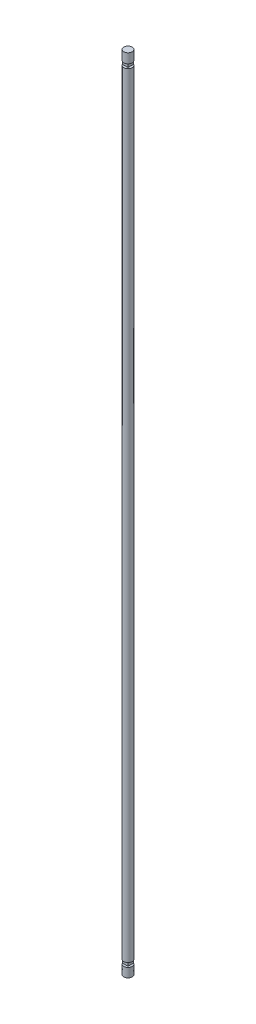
ISO-10303-21;
HEADER;
FILE_DESCRIPTION(('STEP AP214'),'2;1');
FILE_NAME('part.step','',(''),(''),'','','');
FILE_SCHEMA(('AUTOMOTIVE_DESIGN { 1 0 10303 214 1 1 1 1 }'));
ENDSEC;
DATA;
#1=APPLICATION_CONTEXT('core data for automotive mechanical design processes');
#2=APPLICATION_PROTOCOL_DEFINITION('international standard','automotive_design',2000,#1);
#3=PRODUCT_CONTEXT('',#1,'mechanical');
#4=PRODUCT('Part','Part','',(#3));
#5=PRODUCT_RELATED_PRODUCT_CATEGORY('part','',(#4));
#6=PRODUCT_DEFINITION_FORMATION('','',#4);
#7=PRODUCT_DEFINITION_CONTEXT('part definition',#1,'design');
#8=PRODUCT_DEFINITION('design','',#6,#7);
#9=PRODUCT_DEFINITION_SHAPE('','',#8);
#10=(LENGTH_UNIT() NAMED_UNIT(*) SI_UNIT(.MILLI.,.METRE.));
#11=(NAMED_UNIT(*) PLANE_ANGLE_UNIT() SI_UNIT($,.RADIAN.));
#12=(NAMED_UNIT(*) SI_UNIT($,.STERADIAN.) SOLID_ANGLE_UNIT());
#13=UNCERTAINTY_MEASURE_WITH_UNIT(LENGTH_MEASURE(1.E-05),#10,'distance_accuracy_value','');
#14=(GEOMETRIC_REPRESENTATION_CONTEXT(3) GLOBAL_UNCERTAINTY_ASSIGNED_CONTEXT((#13)) GLOBAL_UNIT_ASSIGNED_CONTEXT((#10,
#11,#12)) REPRESENTATION_CONTEXT('',''));
#15=CARTESIAN_POINT('',(0.,0.,0.));
#16=DIRECTION('',(0.,0.,1.));
#17=DIRECTION('',(1.,0.,0.));
#18=AXIS2_PLACEMENT_3D('',#15,#16,#17);
#19=CARTESIAN_POINT('',(-13.4418414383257,898.7155,2.2225));
#20=DIRECTION('',(0.,0.,1.));
#21=DIRECTION('',(1.,0.,0.));
#22=AXIS2_PLACEMENT_3D('',#19,#20,#21);
#23=PLANE('',#22);
#24=DIRECTION('',(1.,0.,0.));
#25=VECTOR('',#24,1.);
#26=CARTESIAN_POINT('',(-13.4418414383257,898.7155,2.2225));
#27=LINE('',#26,#25);
#28=CARTESIAN_POINT('',(-4.21211348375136,898.7155,2.2225));
#29=VERTEX_POINT('',#28);
#30=CARTESIAN_POINT('',(2.2225,898.7155,2.2225));
#31=VERTEX_POINT('',#30);
#32=EDGE_CURVE('E124',#29,#31,#27,.T.);
#33=ORIENTED_EDGE('',*,*,#32,.T.);
#34=DIRECTION('',(0.,1.,0.));
#35=VECTOR('',#34,1.);
#36=CARTESIAN_POINT('',(2.2225,898.7155,2.2225));
#37=LINE('',#36,#35);
#38=CARTESIAN_POINT('',(2.2225,903.478,2.2225));
#39=VERTEX_POINT('',#38);
#40=EDGE_CURVE('E48',#31,#39,#37,.T.);
#41=ORIENTED_EDGE('',*,*,#40,.T.);
#42=DIRECTION('',(-1.,0.,0.));
#43=VECTOR('',#42,1.);
#44=CARTESIAN_POINT('',(-13.4418414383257,903.478,2.2225));
#45=LINE('',#44,#43);
#46=CARTESIAN_POINT('',(-4.21211348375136,903.478,2.2225));
#47=VERTEX_POINT('',#46);
#48=EDGE_CURVE('E127',#39,#47,#45,.T.);
#49=ORIENTED_EDGE('',*,*,#48,.T.);
#50=DIRECTION('',(0.,-1.,0.));
#51=VECTOR('',#50,1.);
#52=CARTESIAN_POINT('',(-4.21211348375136,914.4,2.2225));
#53=LINE('',#52,#51);
#54=EDGE_CURVE('E139',#47,#29,#53,.T.);
#55=ORIENTED_EDGE('',*,*,#54,.T.);
#56=EDGE_LOOP('',(#33,#41,#49,#55));
#57=FACE_BOUND('',#56,.T.);
#58=ADVANCED_FACE('F40',(#57),#23,.T.);
#59=CARTESIAN_POINT('',(0.,914.4,0.));
#60=DIRECTION('',(0.,-1.,0.));
#61=DIRECTION('',(0.,0.,-1.));
#62=AXIS2_PLACEMENT_3D('',#59,#60,#61);
#63=CYLINDRICAL_SURFACE('',#62,4.7625);
#64=CARTESIAN_POINT('',(0.,15.1765,0.));
#65=DIRECTION('',(0.,1.,0.));
#66=DIRECTION('',(0.,0.,1.));
#67=AXIS2_PLACEMENT_3D('',#64,#65,#66);
#68=CIRCLE('',#67,4.7625);
#69=CARTESIAN_POINT('',(-4.21211348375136,15.1765,2.2225));
#70=VERTEX_POINT('',#69);
#71=CARTESIAN_POINT('',(2.2225,15.1765,-4.21211348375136));
#72=VERTEX_POINT('',#71);
#73=EDGE_CURVE('E95',#70,#72,#68,.T.);
#74=ORIENTED_EDGE('',*,*,#73,.T.);
#75=DIRECTION('',(0.,-1.,0.));
#76=VECTOR('',#75,1.);
#77=CARTESIAN_POINT('',(2.2225,914.4,-4.21211348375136));
#78=LINE('',#77,#76);
#79=CARTESIAN_POINT('',(2.2225,10.414,-4.21211348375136));
#80=VERTEX_POINT('',#79);
#81=EDGE_CURVE('E97',#72,#80,#78,.T.);
#82=ORIENTED_EDGE('',*,*,#81,.T.);
#83=CARTESIAN_POINT('',(0.,10.414,0.));
#84=DIRECTION('',(0.,-1.,0.));
#85=DIRECTION('',(0.,0.,-1.));
#86=AXIS2_PLACEMENT_3D('',#83,#84,#85);
#87=CIRCLE('',#86,4.7625);
#88=CARTESIAN_POINT('',(-4.21211348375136,10.414,2.2225));
#89=VERTEX_POINT('',#88);
#90=EDGE_CURVE('E102',#80,#89,#87,.T.);
#91=ORIENTED_EDGE('',*,*,#90,.T.);
#92=DIRECTION('',(0.,-1.,0.));
#93=VECTOR('',#92,1.);
#94=CARTESIAN_POINT('',(-4.21211348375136,914.4,2.2225));
#95=LINE('',#94,#93);
#96=EDGE_CURVE('E99',#70,#89,#95,.T.);
#97=ORIENTED_EDGE('',*,*,#96,.F.);
#98=EDGE_LOOP('',(#74,#82,#91,#97));
#99=FACE_BOUND('',#98,.T.);
#100=CARTESIAN_POINT('',(0.,903.478,0.));
#101=DIRECTION('',(0.,1.,0.));
#102=DIRECTION('',(0.,0.,1.));
#103=AXIS2_PLACEMENT_3D('',#100,#101,#102);
#104=CIRCLE('',#103,4.7625);
#105=CARTESIAN_POINT('',(2.2225,903.478,-4.21211348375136));
#106=VERTEX_POINT('',#105);
#107=EDGE_CURVE('E137',#47,#106,#104,.T.);
#108=ORIENTED_EDGE('',*,*,#107,.T.);
#109=DIRECTION('',(0.,-1.,0.));
#110=VECTOR('',#109,1.);
#111=CARTESIAN_POINT('',(2.2225,914.4,-4.21211348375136));
#112=LINE('',#111,#110);
#113=CARTESIAN_POINT('',(2.2225,898.7155,-4.21211348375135));
#114=VERTEX_POINT('',#113);
#115=EDGE_CURVE('E118',#114,#106,#112,.F.);
#116=ORIENTED_EDGE('',*,*,#115,.F.);
#117=CARTESIAN_POINT('',(0.,898.7155,0.));
#118=DIRECTION('',(0.,-1.,0.));
#119=DIRECTION('',(0.,0.,-1.));
#120=AXIS2_PLACEMENT_3D('',#117,#118,#119);
#121=CIRCLE('',#120,4.7625);
#122=EDGE_CURVE('E135',#114,#29,#121,.T.);
#123=ORIENTED_EDGE('',*,*,#122,.T.);
#124=ORIENTED_EDGE('',*,*,#54,.F.);
#125=EDGE_LOOP('',(#108,#116,#123,#124));
#126=FACE_BOUND('',#125,.T.);
#127=CARTESIAN_POINT('',(0.,914.4,0.));
#128=DIRECTION('',(0.,1.,0.));
#129=DIRECTION('',(0.,0.,1.));
#130=AXIS2_PLACEMENT_3D('',#127,#128,#129);
#131=CIRCLE('',#130,4.7625);
#132=CARTESIAN_POINT('',(0.,914.4,4.7625));
#133=VERTEX_POINT('',#132);
#134=EDGE_CURVE('E132',#133,#133,#131,.T.);
#135=ORIENTED_EDGE('',*,*,#134,.F.);
#136=EDGE_LOOP('',(#135));
#137=FACE_BOUND('',#136,.T.);
#138=CARTESIAN_POINT('',(0.,0.,0.));
#139=DIRECTION('',(0.,1.,0.));
#140=DIRECTION('',(0.,0.,1.));
#141=AXIS2_PLACEMENT_3D('',#138,#139,#140);
#142=CIRCLE('',#141,4.7625);
#143=CARTESIAN_POINT('',(0.,0.,4.7625));
#144=VERTEX_POINT('',#143);
#145=EDGE_CURVE('E129',#144,#144,#142,.T.);
#146=ORIENTED_EDGE('',*,*,#145,.T.);
#147=EDGE_LOOP('',(#146));
#148=FACE_BOUND('',#147,.T.);
#149=ADVANCED_FACE('F42',(#99,#126,#137,#148),#63,.T.);
#150=CARTESIAN_POINT('',(0.,914.4,0.));
#151=DIRECTION('',(0.,1.,0.));
#152=DIRECTION('',(0.,0.,1.));
#153=AXIS2_PLACEMENT_3D('',#150,#151,#152);
#154=PLANE('',#153);
#155=ORIENTED_EDGE('',*,*,#134,.T.);
#156=EDGE_LOOP('',(#155));
#157=FACE_BOUND('',#156,.T.);
#158=ADVANCED_FACE('F172',(#157),#154,.T.);
#159=CARTESIAN_POINT('',(0.,0.,0.));
#160=DIRECTION('',(0.,1.,0.));
#161=DIRECTION('',(0.,0.,1.));
#162=AXIS2_PLACEMENT_3D('',#159,#160,#161);
#163=PLANE('',#162);
#164=ORIENTED_EDGE('',*,*,#145,.F.);
#165=EDGE_LOOP('',(#164));
#166=FACE_BOUND('',#165,.T.);
#167=ADVANCED_FACE('F178',(#166),#163,.F.);
#168=CARTESIAN_POINT('',(-13.4418414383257,903.478,2.2225));
#169=DIRECTION('',(0.,1.,0.));
#170=DIRECTION('',(0.,0.,1.));
#171=AXIS2_PLACEMENT_3D('',#168,#169,#170);
#172=PLANE('',#171);
#173=DIRECTION('',(0.,0.,1.));
#174=VECTOR('',#173,1.);
#175=CARTESIAN_POINT('',(2.2225,903.478,12.0403822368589));
#176=LINE('',#175,#174);
#177=EDGE_CURVE('E62',#106,#39,#176,.T.);
#178=ORIENTED_EDGE('',*,*,#177,.F.);
#179=ORIENTED_EDGE('',*,*,#107,.F.);
#180=ORIENTED_EDGE('',*,*,#48,.F.);
#181=EDGE_LOOP('',(#178,#179,#180));
#182=FACE_BOUND('',#181,.T.);
#183=ADVANCED_FACE('F149',(#182),#172,.F.);
#184=CARTESIAN_POINT('',(-13.4418414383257,898.7155,2.2225));
#185=DIRECTION('',(0.,-1.,0.));
#186=DIRECTION('',(0.,0.,-1.));
#187=AXIS2_PLACEMENT_3D('',#184,#185,#186);
#188=PLANE('',#187);
#189=ORIENTED_EDGE('',*,*,#122,.F.);
#190=DIRECTION('',(0.,0.,-1.));
#191=VECTOR('',#190,1.);
#192=CARTESIAN_POINT('',(2.2225,898.7155,12.0403822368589));
#193=LINE('',#192,#191);
#194=EDGE_CURVE('E108',#31,#114,#193,.T.);
#195=ORIENTED_EDGE('',*,*,#194,.F.);
#196=ORIENTED_EDGE('',*,*,#32,.F.);
#197=EDGE_LOOP('',(#189,#195,#196));
#198=FACE_BOUND('',#197,.T.);
#199=ADVANCED_FACE('F154',(#198),#188,.F.);
#200=CARTESIAN_POINT('',(-9.97120808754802,15.1765,2.2225));
#201=DIRECTION('',(0.,1.,0.));
#202=DIRECTION('',(0.,0.,1.));
#203=AXIS2_PLACEMENT_3D('',#200,#201,#202);
#204=PLANE('',#203);
#205=DIRECTION('',(-1.,0.,0.));
#206=VECTOR('',#205,1.);
#207=CARTESIAN_POINT('',(-9.97120808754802,15.1765,2.2225));
#208=LINE('',#207,#206);
#209=CARTESIAN_POINT('',(2.2225,15.1765,2.2225));
#210=VERTEX_POINT('',#209);
#211=EDGE_CURVE('E111',#210,#70,#208,.T.);
#212=ORIENTED_EDGE('',*,*,#211,.F.);
#213=DIRECTION('',(0.,0.,1.));
#214=VECTOR('',#213,1.);
#215=CARTESIAN_POINT('',(2.2225,15.1765,8.02951798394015));
#216=LINE('',#215,#214);
#217=EDGE_CURVE('E54',#72,#210,#216,.T.);
#218=ORIENTED_EDGE('',*,*,#217,.F.);
#219=ORIENTED_EDGE('',*,*,#73,.F.);
#220=EDGE_LOOP('',(#212,#218,#219));
#221=FACE_BOUND('',#220,.T.);
#222=ADVANCED_FACE('F110',(#221),#204,.F.);
#223=CARTESIAN_POINT('',(-9.97120808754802,10.414,2.2225));
#224=DIRECTION('',(0.,-1.,0.));
#225=DIRECTION('',(0.,0.,-1.));
#226=AXIS2_PLACEMENT_3D('',#223,#224,#225);
#227=PLANE('',#226);
#228=DIRECTION('',(1.,0.,0.));
#229=VECTOR('',#228,1.);
#230=CARTESIAN_POINT('',(-9.97120808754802,10.414,2.2225));
#231=LINE('',#230,#229);
#232=CARTESIAN_POINT('',(2.2225,10.414,2.2225));
#233=VERTEX_POINT('',#232);
#234=EDGE_CURVE('E120',#89,#233,#231,.T.);
#235=ORIENTED_EDGE('',*,*,#234,.F.);
#236=ORIENTED_EDGE('',*,*,#90,.F.);
#237=DIRECTION('',(0.,0.,-1.));
#238=VECTOR('',#237,1.);
#239=CARTESIAN_POINT('',(2.2225,10.414,8.02951798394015));
#240=LINE('',#239,#238);
#241=EDGE_CURVE('E107',#233,#80,#240,.T.);
#242=ORIENTED_EDGE('',*,*,#241,.F.);
#243=EDGE_LOOP('',(#235,#236,#242));
#244=FACE_BOUND('',#243,.T.);
#245=ADVANCED_FACE('F164',(#244),#227,.F.);
#246=CARTESIAN_POINT('',(-9.97120808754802,10.414,2.2225));
#247=DIRECTION('',(0.,0.,1.));
#248=DIRECTION('',(1.,0.,0.));
#249=AXIS2_PLACEMENT_3D('',#246,#247,#248);
#250=PLANE('',#249);
#251=DIRECTION('',(0.,-1.,0.));
#252=VECTOR('',#251,1.);
#253=CARTESIAN_POINT('',(2.2225,10.414,2.2225));
#254=LINE('',#253,#252);
#255=EDGE_CURVE('E11',#210,#233,#254,.T.);
#256=ORIENTED_EDGE('',*,*,#255,.F.);
#257=ORIENTED_EDGE('',*,*,#211,.T.);
#258=ORIENTED_EDGE('',*,*,#96,.T.);
#259=ORIENTED_EDGE('',*,*,#234,.T.);
#260=EDGE_LOOP('',(#256,#257,#258,#259));
#261=FACE_BOUND('',#260,.T.);
#262=ADVANCED_FACE('F157',(#261),#250,.T.);
#263=CARTESIAN_POINT('',(2.2225,898.7155,12.0403822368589));
#264=DIRECTION('',(1.,0.,0.));
#265=DIRECTION('',(0.,0.,-1.));
#266=AXIS2_PLACEMENT_3D('',#263,#264,#265);
#267=PLANE('',#266);
#268=ORIENTED_EDGE('',*,*,#115,.T.);
#269=ORIENTED_EDGE('',*,*,#177,.T.);
#270=ORIENTED_EDGE('',*,*,#40,.F.);
#271=ORIENTED_EDGE('',*,*,#194,.T.);
#272=EDGE_LOOP('',(#268,#269,#270,#271));
#273=FACE_BOUND('',#272,.T.);
#274=ADVANCED_FACE('F155',(#273),#267,.T.);
#275=CARTESIAN_POINT('',(2.2225,15.1765,8.02951798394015));
#276=DIRECTION('',(-1.,0.,0.));
#277=DIRECTION('',(0.,0.,1.));
#278=AXIS2_PLACEMENT_3D('',#275,#276,#277);
#279=PLANE('',#278);
#280=ORIENTED_EDGE('',*,*,#217,.T.);
#281=ORIENTED_EDGE('',*,*,#255,.T.);
#282=ORIENTED_EDGE('',*,*,#241,.T.);
#283=ORIENTED_EDGE('',*,*,#81,.F.);
#284=EDGE_LOOP('',(#280,#281,#282,#283));
#285=FACE_BOUND('',#284,.T.);
#286=ADVANCED_FACE('F105',(#285),#279,.F.);
#287=CLOSED_SHELL('',(#58,#149,#158,#167,#183,#199,#222,#245,#262,#274,#286));
#288=MANIFOLD_SOLID_BREP('B2',#287);
#289=ADVANCED_BREP_SHAPE_REPRESENTATION('',(#18,#288),#14);
#290=SHAPE_DEFINITION_REPRESENTATION(#9,#289);
ENDSEC;
END-ISO-10303-21;
